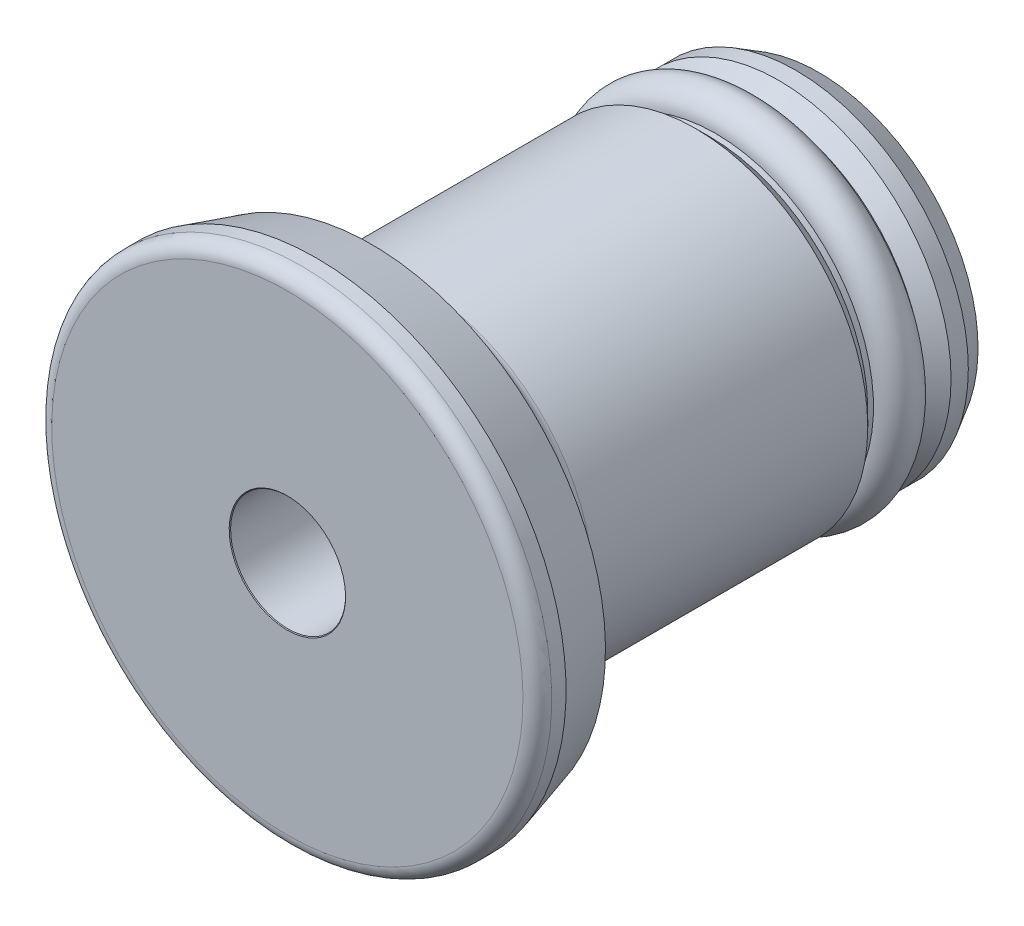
ISO-10303-21;
HEADER;
FILE_DESCRIPTION(('STEP AP214'),'2;1');
FILE_NAME('part.step','',(''),(''),'','','');
FILE_SCHEMA(('AUTOMOTIVE_DESIGN { 1 0 10303 214 1 1 1 1 }'));
ENDSEC;
DATA;
#1=APPLICATION_CONTEXT('core data for automotive mechanical design processes');
#2=APPLICATION_PROTOCOL_DEFINITION('international standard','automotive_design',2000,#1);
#3=PRODUCT_CONTEXT('',#1,'mechanical');
#4=PRODUCT('Part','Part','',(#3));
#5=PRODUCT_RELATED_PRODUCT_CATEGORY('part','',(#4));
#6=PRODUCT_DEFINITION_FORMATION('','',#4);
#7=PRODUCT_DEFINITION_CONTEXT('part definition',#1,'design');
#8=PRODUCT_DEFINITION('design','',#6,#7);
#9=PRODUCT_DEFINITION_SHAPE('','',#8);
#10=(LENGTH_UNIT() NAMED_UNIT(*) SI_UNIT(.MILLI.,.METRE.));
#11=(NAMED_UNIT(*) PLANE_ANGLE_UNIT() SI_UNIT($,.RADIAN.));
#12=(NAMED_UNIT(*) SI_UNIT($,.STERADIAN.) SOLID_ANGLE_UNIT());
#13=UNCERTAINTY_MEASURE_WITH_UNIT(LENGTH_MEASURE(1.E-05),#10,'distance_accuracy_value','');
#14=(GEOMETRIC_REPRESENTATION_CONTEXT(3) GLOBAL_UNCERTAINTY_ASSIGNED_CONTEXT((#13)) GLOBAL_UNIT_ASSIGNED_CONTEXT((#10,
#11,#12)) REPRESENTATION_CONTEXT('',''));
#15=CARTESIAN_POINT('',(0.,0.,0.));
#16=DIRECTION('',(0.,0.,1.));
#17=DIRECTION('',(1.,0.,0.));
#18=AXIS2_PLACEMENT_3D('',#15,#16,#17);
#19=CARTESIAN_POINT('',(0.,0.,-15.65));
#20=DIRECTION('',(0.,0.,1.));
#21=DIRECTION('',(1.,0.,0.));
#22=AXIS2_PLACEMENT_3D('',#19,#20,#21);
#23=TOROIDAL_SURFACE('',#22,5.5,0.75);
#24=CARTESIAN_POINT('',(0.,0.,-16.4));
#25=DIRECTION('',(0.,0.,1.));
#26=DIRECTION('',(0.,-1.,0.));
#27=AXIS2_PLACEMENT_3D('',#24,#25,#26);
#28=CIRCLE('',#27,5.5);
#29=CARTESIAN_POINT('',(0.,-5.5,-16.4));
#30=VERTEX_POINT('',#29);
#31=EDGE_CURVE('E18',#30,#30,#28,.F.);
#32=ORIENTED_EDGE('',*,*,#31,.F.);
#33=EDGE_LOOP('',(#32));
#34=FACE_BOUND('',#33,.T.);
#35=CARTESIAN_POINT('',(0.,0.,-14.9));
#36=DIRECTION('',(0.,0.,-1.));
#37=DIRECTION('',(0.,1.,0.));
#38=AXIS2_PLACEMENT_3D('',#35,#36,#37);
#39=CIRCLE('',#38,5.5);
#40=CARTESIAN_POINT('',(0.,5.5,-14.9));
#41=VERTEX_POINT('',#40);
#42=EDGE_CURVE('E8',#41,#41,#39,.F.);
#43=ORIENTED_EDGE('',*,*,#42,.F.);
#44=EDGE_LOOP('',(#43));
#45=FACE_BOUND('',#44,.T.);
#46=ADVANCED_FACE('F12',(#34,#45),#23,.T.);
#47=CARTESIAN_POINT('',(6.,0.,-18.5));
#48=DIRECTION('',(0.,0.,1.));
#49=DIRECTION('',(0.,-1.,0.));
#50=AXIS2_PLACEMENT_3D('',#47,#48,#49);
#51=PLANE('',#50);
#52=CARTESIAN_POINT('',(0.,0.,-18.5));
#53=DIRECTION('',(0.,0.,1.));
#54=DIRECTION('',(0.,-1.,0.));
#55=AXIS2_PLACEMENT_3D('',#52,#53,#54);
#56=CIRCLE('',#55,5.5381197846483);
#57=CARTESIAN_POINT('',(0.,-5.5381197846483,-18.5));
#58=VERTEX_POINT('',#57);
#59=EDGE_CURVE('E48',#58,#58,#56,.F.);
#60=ORIENTED_EDGE('',*,*,#59,.T.);
#61=EDGE_LOOP('',(#60));
#62=FACE_BOUND('',#61,.T.);
#63=ADVANCED_FACE('F103',(#62),#51,.F.);
#64=CARTESIAN_POINT('',(0.,0.,-17.7));
#65=DIRECTION('',(0.,0.,1.));
#66=DIRECTION('',(0.,-1.,0.));
#67=AXIS2_PLACEMENT_3D('',#64,#65,#66);
#68=CONICAL_SURFACE('',#67,6.,0.523598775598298);
#69=ORIENTED_EDGE('',*,*,#59,.F.);
#70=EDGE_LOOP('',(#69));
#71=FACE_BOUND('',#70,.T.);
#72=CARTESIAN_POINT('',(0.,0.,-17.7));
#73=DIRECTION('',(0.,0.,1.));
#74=DIRECTION('',(0.,-1.,0.));
#75=AXIS2_PLACEMENT_3D('',#72,#73,#74);
#76=CIRCLE('',#75,6.);
#77=CARTESIAN_POINT('',(0.,-6.,-17.7));
#78=VERTEX_POINT('',#77);
#79=EDGE_CURVE('E51',#78,#78,#76,.T.);
#80=ORIENTED_EDGE('',*,*,#79,.F.);
#81=EDGE_LOOP('',(#80));
#82=FACE_BOUND('',#81,.T.);
#83=ADVANCED_FACE('F105',(#71,#82),#68,.T.);
#84=CARTESIAN_POINT('',(0.,0.,0.5));
#85=DIRECTION('',(0.,0.,1.));
#86=DIRECTION('',(0.,-1.,0.));
#87=AXIS2_PLACEMENT_3D('',#84,#85,#86);
#88=CYLINDRICAL_SURFACE('',#87,6.);
#89=CARTESIAN_POINT('',(0.,0.,-17.1));
#90=DIRECTION('',(0.,0.,1.));
#91=DIRECTION('',(0.,-1.,0.));
#92=AXIS2_PLACEMENT_3D('',#89,#90,#91);
#93=CIRCLE('',#92,6.);
#94=CARTESIAN_POINT('',(0.,-6.,-17.1));
#95=VERTEX_POINT('',#94);
#96=EDGE_CURVE('E36',#95,#95,#93,.F.);
#97=ORIENTED_EDGE('',*,*,#96,.T.);
#98=EDGE_LOOP('',(#97));
#99=FACE_BOUND('',#98,.T.);
#100=ORIENTED_EDGE('',*,*,#79,.T.);
#101=EDGE_LOOP('',(#100));
#102=FACE_BOUND('',#101,.T.);
#103=ADVANCED_FACE('F111',(#99,#102),#88,.T.);
#104=CARTESIAN_POINT('',(0.,0.,-16.6));
#105=DIRECTION('',(0.,0.,-1.));
#106=DIRECTION('',(0.,1.,0.));
#107=AXIS2_PLACEMENT_3D('',#104,#105,#106);
#108=CONICAL_SURFACE('',#107,5.5,0.785398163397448);
#109=ORIENTED_EDGE('',*,*,#96,.F.);
#110=EDGE_LOOP('',(#109));
#111=FACE_BOUND('',#110,.T.);
#112=CARTESIAN_POINT('',(0.,0.,-16.6));
#113=DIRECTION('',(0.,0.,1.));
#114=DIRECTION('',(0.,-1.,0.));
#115=AXIS2_PLACEMENT_3D('',#112,#113,#114);
#116=CIRCLE('',#115,5.5);
#117=CARTESIAN_POINT('',(0.,-5.5,-16.6));
#118=VERTEX_POINT('',#117);
#119=EDGE_CURVE('E39',#118,#118,#116,.T.);
#120=ORIENTED_EDGE('',*,*,#119,.F.);
#121=EDGE_LOOP('',(#120));
#122=FACE_BOUND('',#121,.T.);
#123=ADVANCED_FACE('F133',(#111,#122),#108,.T.);
#124=CARTESIAN_POINT('',(0.,0.,1.57111975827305));
#125=DIRECTION('',(0.,0.,1.));
#126=DIRECTION('',(0.,-1.,0.));
#127=AXIS2_PLACEMENT_3D('',#124,#125,#126);
#128=CYLINDRICAL_SURFACE('',#127,5.5);
#129=ORIENTED_EDGE('',*,*,#31,.T.);
#130=EDGE_LOOP('',(#129));
#131=FACE_BOUND('',#130,.T.);
#132=ORIENTED_EDGE('',*,*,#119,.T.);
#133=EDGE_LOOP('',(#132));
#134=FACE_BOUND('',#133,.T.);
#135=ADVANCED_FACE('F116',(#131,#134),#128,.T.);
#136=ORIENTED_EDGE('',*,*,#42,.T.);
#137=EDGE_LOOP('',(#136));
#138=FACE_BOUND('',#137,.T.);
#139=CARTESIAN_POINT('',(0.,0.,-14.7));
#140=DIRECTION('',(0.,0.,-1.));
#141=DIRECTION('',(0.,1.,0.));
#142=AXIS2_PLACEMENT_3D('',#139,#140,#141);
#143=CIRCLE('',#142,5.5);
#144=CARTESIAN_POINT('',(0.,5.5,-14.7));
#145=VERTEX_POINT('',#144);
#146=EDGE_CURVE('E42',#145,#145,#143,.T.);
#147=ORIENTED_EDGE('',*,*,#146,.T.);
#148=EDGE_LOOP('',(#147));
#149=FACE_BOUND('',#148,.T.);
#150=ADVANCED_FACE('F115',(#138,#149),#128,.T.);
#151=CARTESIAN_POINT('',(0.,0.,-14.2));
#152=DIRECTION('',(0.,0.,-1.));
#153=DIRECTION('',(0.,1.,0.));
#154=AXIS2_PLACEMENT_3D('',#151,#152,#153);
#155=CIRCLE('',#154,6.);
#156=CARTESIAN_POINT('',(0.,6.,-14.2));
#157=VERTEX_POINT('',#156);
#158=EDGE_CURVE('E45',#157,#157,#155,.F.);
#159=ORIENTED_EDGE('',*,*,#158,.T.);
#160=EDGE_LOOP('',(#159));
#161=FACE_BOUND('',#160,.T.);
#162=CARTESIAN_POINT('',(0.,0.,-4.63530385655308));
#163=DIRECTION('',(0.,0.,1.));
#164=DIRECTION('',(0.,-1.,0.));
#165=AXIS2_PLACEMENT_3D('',#162,#163,#164);
#166=CIRCLE('',#165,6.);
#167=CARTESIAN_POINT('',(0.,-6.,-4.63530385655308));
#168=VERTEX_POINT('',#167);
#169=EDGE_CURVE('E54',#168,#168,#166,.F.);
#170=ORIENTED_EDGE('',*,*,#169,.T.);
#171=EDGE_LOOP('',(#170));
#172=FACE_BOUND('',#171,.T.);
#173=ADVANCED_FACE('F118',(#161,#172),#88,.T.);
#174=CARTESIAN_POINT('',(0.,0.,0.5));
#175=DIRECTION('',(0.,0.,1.));
#176=DIRECTION('',(0.,-1.,0.));
#177=AXIS2_PLACEMENT_3D('',#174,#175,#176);
#178=CYLINDRICAL_SURFACE('',#177,8.7);
#179=CARTESIAN_POINT('',(0.,0.,-0.5));
#180=DIRECTION('',(0.,0.,1.));
#181=DIRECTION('',(0.,-1.,0.));
#182=AXIS2_PLACEMENT_3D('',#179,#180,#181);
#183=CIRCLE('',#182,8.7);
#184=CARTESIAN_POINT('',(0.,-8.7,-0.5));
#185=VERTEX_POINT('',#184);
#186=EDGE_CURVE('E22',#185,#185,#183,.F.);
#187=ORIENTED_EDGE('',*,*,#186,.T.);
#188=EDGE_LOOP('',(#187));
#189=FACE_BOUND('',#188,.T.);
#190=CARTESIAN_POINT('',(0.,0.,-1.));
#191=DIRECTION('',(0.,0.,1.));
#192=DIRECTION('',(0.,-1.,0.));
#193=AXIS2_PLACEMENT_3D('',#190,#191,#192);
#194=CIRCLE('',#193,8.7);
#195=CARTESIAN_POINT('',(0.,-8.7,-1.));
#196=VERTEX_POINT('',#195);
#197=EDGE_CURVE('E60',#196,#196,#194,.T.);
#198=ORIENTED_EDGE('',*,*,#197,.T.);
#199=EDGE_LOOP('',(#198));
#200=FACE_BOUND('',#199,.T.);
#201=ADVANCED_FACE('F120',(#189,#200),#178,.T.);
#202=CARTESIAN_POINT('',(0.,0.,-2.92252339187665));
#203=DIRECTION('',(0.,0.,1.));
#204=DIRECTION('',(0.,-1.,0.));
#205=AXIS2_PLACEMENT_3D('',#202,#203,#204);
#206=CONICAL_SURFACE('',#205,8.14872528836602,0.279252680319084);
#207=ORIENTED_EDGE('',*,*,#197,.F.);
#208=EDGE_LOOP('',(#207));
#209=FACE_BOUND('',#208,.T.);
#210=CARTESIAN_POINT('',(0.,0.,-2.92252339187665));
#211=DIRECTION('',(0.,0.,1.));
#212=DIRECTION('',(0.,-1.,0.));
#213=AXIS2_PLACEMENT_3D('',#210,#211,#212);
#214=CIRCLE('',#213,8.14872528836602);
#215=CARTESIAN_POINT('',(0.,-8.14872528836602,-2.92252339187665));
#216=VERTEX_POINT('',#215);
#217=EDGE_CURVE('E63',#216,#216,#214,.T.);
#218=ORIENTED_EDGE('',*,*,#217,.T.);
#219=EDGE_LOOP('',(#218));
#220=FACE_BOUND('',#219,.T.);
#221=ADVANCED_FACE('F99',(#209,#220),#206,.T.);
#222=CARTESIAN_POINT('',(0.,0.,-4.42707703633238));
#223=DIRECTION('',(0.,0.,1.));
#224=DIRECTION('',(0.,-1.,0.));
#225=AXIS2_PLACEMENT_3D('',#222,#223,#224);
#226=CONICAL_SURFACE('',#225,6.,0.959931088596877);
#227=CARTESIAN_POINT('',(0.,0.,-4.30764303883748));
#228=DIRECTION('',(0.,0.,1.));
#229=DIRECTION('',(0.,-1.,0.));
#230=AXIS2_PLACEMENT_3D('',#227,#228,#229);
#231=CIRCLE('',#230,6.17056942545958);
#232=CARTESIAN_POINT('',(0.,-6.17056942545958,-4.30764303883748));
#233=VERTEX_POINT('',#232);
#234=EDGE_CURVE('E57',#233,#233,#231,.T.);
#235=ORIENTED_EDGE('',*,*,#234,.T.);
#236=EDGE_LOOP('',(#235));
#237=FACE_BOUND('',#236,.T.);
#238=ORIENTED_EDGE('',*,*,#217,.F.);
#239=EDGE_LOOP('',(#238));
#240=FACE_BOUND('',#239,.T.);
#241=ADVANCED_FACE('F89',(#237,#240),#226,.T.);
#242=CARTESIAN_POINT('',(8.7,0.,0.));
#243=DIRECTION('',(0.,0.,1.));
#244=DIRECTION('',(0.,-1.,0.));
#245=AXIS2_PLACEMENT_3D('',#242,#243,#244);
#246=PLANE('',#245);
#247=CARTESIAN_POINT('',(0.,0.,0.));
#248=DIRECTION('',(0.,0.,1.));
#249=DIRECTION('',(0.,-1.,0.));
#250=AXIS2_PLACEMENT_3D('',#247,#248,#249);
#251=CIRCLE('',#250,8.2);
#252=CARTESIAN_POINT('',(0.,-8.2,0.));
#253=VERTEX_POINT('',#252);
#254=EDGE_CURVE('E26',#253,#253,#251,.T.);
#255=ORIENTED_EDGE('',*,*,#254,.T.);
#256=EDGE_LOOP('',(#255));
#257=FACE_BOUND('',#256,.T.);
#258=CARTESIAN_POINT('',(0.,0.,0.));
#259=DIRECTION('',(0.,0.,1.));
#260=DIRECTION('',(0.,-1.,0.));
#261=AXIS2_PLACEMENT_3D('',#258,#259,#260);
#262=CIRCLE('',#261,2.025);
#263=CARTESIAN_POINT('',(0.,-2.025,0.));
#264=VERTEX_POINT('',#263);
#265=EDGE_CURVE('E31',#264,#264,#262,.T.);
#266=ORIENTED_EDGE('',*,*,#265,.F.);
#267=EDGE_LOOP('',(#266));
#268=FACE_BOUND('',#267,.T.);
#269=ADVANCED_FACE('F87',(#257,#268),#246,.T.);
#270=CARTESIAN_POINT('',(0.,0.,-4.63530385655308));
#271=DIRECTION('',(0.,0.,1.));
#272=DIRECTION('',(0.,-1.,0.));
#273=AXIS2_PLACEMENT_3D('',#270,#271,#272);
#274=TOROIDAL_SURFACE('',#273,6.4,0.4);
#275=ORIENTED_EDGE('',*,*,#169,.F.);
#276=EDGE_LOOP('',(#275));
#277=FACE_BOUND('',#276,.T.);
#278=ORIENTED_EDGE('',*,*,#234,.F.);
#279=EDGE_LOOP('',(#278));
#280=FACE_BOUND('',#279,.T.);
#281=ADVANCED_FACE('F83',(#277,#280),#274,.F.);
#282=CARTESIAN_POINT('',(0.,0.,0.));
#283=DIRECTION('',(0.,0.,1.));
#284=DIRECTION('',(0.,-1.,0.));
#285=AXIS2_PLACEMENT_3D('',#282,#283,#284);
#286=CONICAL_SURFACE('',#285,2.025,0.78539816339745);
#287=CARTESIAN_POINT('',(0.,0.,-0.0250000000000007));
#288=DIRECTION('',(0.,0.,1.));
#289=DIRECTION('',(0.,-1.,0.));
#290=AXIS2_PLACEMENT_3D('',#287,#288,#289);
#291=CIRCLE('',#290,2.);
#292=CARTESIAN_POINT('',(0.,-2.,-0.0250000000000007));
#293=VERTEX_POINT('',#292);
#294=EDGE_CURVE('E29',#293,#293,#291,.F.);
#295=ORIENTED_EDGE('',*,*,#294,.T.);
#296=EDGE_LOOP('',(#295));
#297=FACE_BOUND('',#296,.T.);
#298=ORIENTED_EDGE('',*,*,#265,.T.);
#299=EDGE_LOOP('',(#298));
#300=FACE_BOUND('',#299,.T.);
#301=ADVANCED_FACE('F79',(#297,#300),#286,.F.);
#302=CARTESIAN_POINT('',(0.,0.,-14.2));
#303=DIRECTION('',(0.,0.,1.));
#304=DIRECTION('',(0.,-1.,0.));
#305=AXIS2_PLACEMENT_3D('',#302,#303,#304);
#306=CONICAL_SURFACE('',#305,6.,0.78539816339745);
#307=ORIENTED_EDGE('',*,*,#146,.F.);
#308=EDGE_LOOP('',(#307));
#309=FACE_BOUND('',#308,.T.);
#310=ORIENTED_EDGE('',*,*,#158,.F.);
#311=EDGE_LOOP('',(#310));
#312=FACE_BOUND('',#311,.T.);
#313=ADVANCED_FACE('F82',(#309,#312),#306,.T.);
#314=CARTESIAN_POINT('',(0.,0.,-0.5));
#315=DIRECTION('',(0.,0.,1.));
#316=DIRECTION('',(0.,-1.,0.));
#317=AXIS2_PLACEMENT_3D('',#314,#315,#316);
#318=TOROIDAL_SURFACE('',#317,8.2,0.5);
#319=ORIENTED_EDGE('',*,*,#186,.F.);
#320=EDGE_LOOP('',(#319));
#321=FACE_BOUND('',#320,.T.);
#322=ORIENTED_EDGE('',*,*,#254,.F.);
#323=EDGE_LOOP('',(#322));
#324=FACE_BOUND('',#323,.T.);
#325=ADVANCED_FACE('F131',(#321,#324),#318,.T.);
#326=CARTESIAN_POINT('',(0.,0.,-6.));
#327=DIRECTION('',(0.,0.,1.));
#328=DIRECTION('',(0.,-1.,0.));
#329=AXIS2_PLACEMENT_3D('',#326,#327,#328);
#330=PLANE('',#329);
#331=CARTESIAN_POINT('',(0.,0.,-6.));
#332=DIRECTION('',(0.,0.,1.));
#333=DIRECTION('',(0.,-1.,0.));
#334=AXIS2_PLACEMENT_3D('',#331,#332,#333);
#335=CIRCLE('',#334,2.);
#336=CARTESIAN_POINT('',(0.,-2.,-6.));
#337=VERTEX_POINT('',#336);
#338=EDGE_CURVE('E32',#337,#337,#335,.T.);
#339=ORIENTED_EDGE('',*,*,#338,.T.);
#340=EDGE_LOOP('',(#339));
#341=FACE_BOUND('',#340,.T.);
#342=ADVANCED_FACE('F71',(#341),#330,.T.);
#343=CARTESIAN_POINT('',(0.,0.,-6.));
#344=DIRECTION('',(0.,0.,1.));
#345=DIRECTION('',(0.,-1.,0.));
#346=AXIS2_PLACEMENT_3D('',#343,#344,#345);
#347=CYLINDRICAL_SURFACE('',#346,2.);
#348=ORIENTED_EDGE('',*,*,#338,.F.);
#349=EDGE_LOOP('',(#348));
#350=FACE_BOUND('',#349,.T.);
#351=ORIENTED_EDGE('',*,*,#294,.F.);
#352=EDGE_LOOP('',(#351));
#353=FACE_BOUND('',#352,.T.);
#354=ADVANCED_FACE('F73',(#350,#353),#347,.F.);
#355=CLOSED_SHELL('',(#46,#63,#83,#103,#123,#135,#150,#173,#201,#221,#241,#269,#281,#301,#313,
#325,#342,#354));
#356=MANIFOLD_SOLID_BREP('B1',#355);
#357=ADVANCED_BREP_SHAPE_REPRESENTATION('',(#18,#356),#14);
#358=SHAPE_DEFINITION_REPRESENTATION(#9,#357);
ENDSEC;
END-ISO-10303-21;
